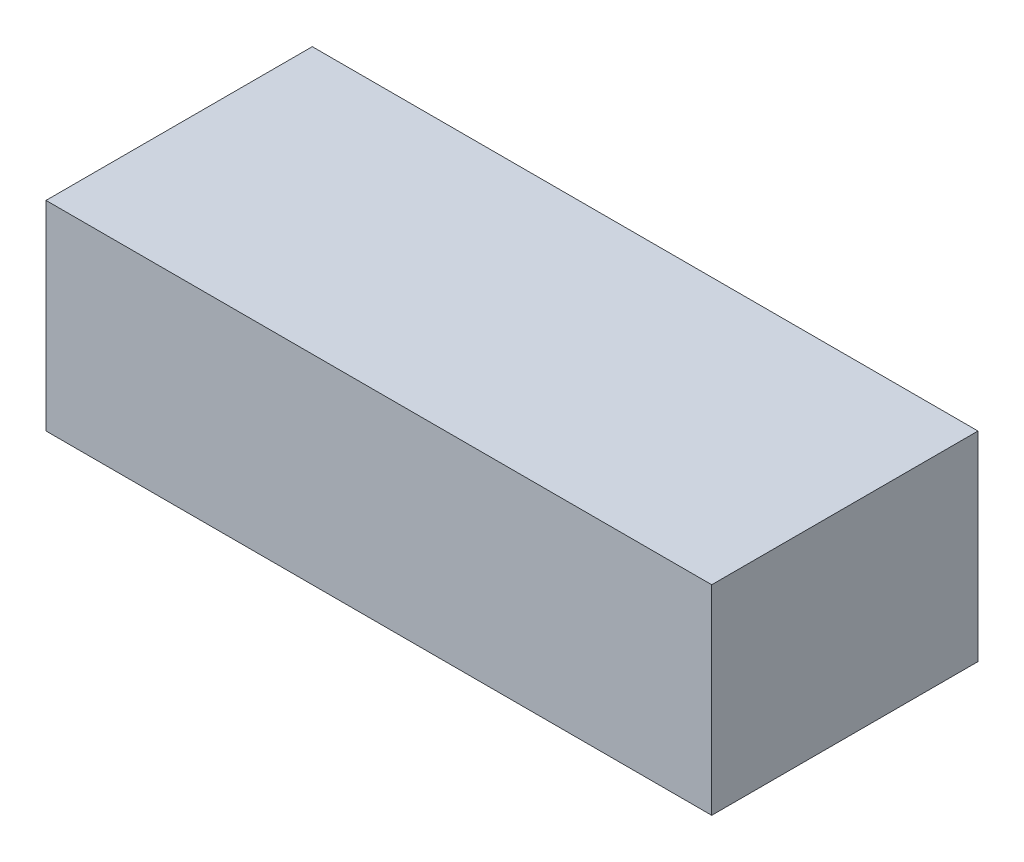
ISO-10303-21;
HEADER;
FILE_DESCRIPTION(('STEP AP214'),'2;1');
FILE_NAME('part.step','',(''),(''),'','','');
FILE_SCHEMA(('AUTOMOTIVE_DESIGN { 1 0 10303 214 1 1 1 1 }'));
ENDSEC;
DATA;
#1=APPLICATION_CONTEXT('core data for automotive mechanical design processes');
#2=APPLICATION_PROTOCOL_DEFINITION('international standard','automotive_design',2000,#1);
#3=PRODUCT_CONTEXT('',#1,'mechanical');
#4=PRODUCT('Part','Part','',(#3));
#5=PRODUCT_RELATED_PRODUCT_CATEGORY('part','',(#4));
#6=PRODUCT_DEFINITION_FORMATION('','',#4);
#7=PRODUCT_DEFINITION_CONTEXT('part definition',#1,'design');
#8=PRODUCT_DEFINITION('design','',#6,#7);
#9=PRODUCT_DEFINITION_SHAPE('','',#8);
#10=(LENGTH_UNIT() NAMED_UNIT(*) SI_UNIT(.MILLI.,.METRE.));
#11=(NAMED_UNIT(*) PLANE_ANGLE_UNIT() SI_UNIT($,.RADIAN.));
#12=(NAMED_UNIT(*) SI_UNIT($,.STERADIAN.) SOLID_ANGLE_UNIT());
#13=UNCERTAINTY_MEASURE_WITH_UNIT(LENGTH_MEASURE(1.E-05),#10,'distance_accuracy_value','');
#14=(GEOMETRIC_REPRESENTATION_CONTEXT(3) GLOBAL_UNCERTAINTY_ASSIGNED_CONTEXT((#13)) GLOBAL_UNIT_ASSIGNED_CONTEXT((#10,
#11,#12)) REPRESENTATION_CONTEXT('',''));
#15=CARTESIAN_POINT('',(0.,0.,0.));
#16=DIRECTION('',(0.,0.,1.));
#17=DIRECTION('',(1.,0.,0.));
#18=AXIS2_PLACEMENT_3D('',#15,#16,#17);
#19=CARTESIAN_POINT('',(-250.,-75.,100.));
#20=DIRECTION('',(1.,0.,0.));
#21=DIRECTION('',(0.,0.,-1.));
#22=AXIS2_PLACEMENT_3D('',#19,#20,#21);
#23=PLANE('',#22);
#24=DIRECTION('',(0.,-1.,0.));
#25=VECTOR('',#24,1.);
#26=CARTESIAN_POINT('',(-250.,-75.,-100.));
#27=LINE('',#26,#25);
#28=CARTESIAN_POINT('',(-250.,75.,-100.));
#29=VERTEX_POINT('',#28);
#30=CARTESIAN_POINT('',(-250.,-75.,-100.));
#31=VERTEX_POINT('',#30);
#32=EDGE_CURVE('E133',#29,#31,#27,.T.);
#33=ORIENTED_EDGE('',*,*,#32,.T.);
#34=DIRECTION('',(0.,0.,-1.));
#35=VECTOR('',#34,1.);
#36=CARTESIAN_POINT('',(-250.,-75.,100.));
#37=LINE('',#36,#35);
#38=CARTESIAN_POINT('',(-250.,-75.,100.));
#39=VERTEX_POINT('',#38);
#40=EDGE_CURVE('E11',#39,#31,#37,.T.);
#41=ORIENTED_EDGE('',*,*,#40,.F.);
#42=DIRECTION('',(0.,-1.,0.));
#43=VECTOR('',#42,1.);
#44=CARTESIAN_POINT('',(-250.,-75.,100.));
#45=LINE('',#44,#43);
#46=CARTESIAN_POINT('',(-250.,75.,100.));
#47=VERTEX_POINT('',#46);
#48=EDGE_CURVE('E134',#47,#39,#45,.T.);
#49=ORIENTED_EDGE('',*,*,#48,.F.);
#50=DIRECTION('',(0.,0.,-1.));
#51=VECTOR('',#50,1.);
#52=CARTESIAN_POINT('',(-250.,75.,100.));
#53=LINE('',#52,#51);
#54=EDGE_CURVE('E144',#47,#29,#53,.T.);
#55=ORIENTED_EDGE('',*,*,#54,.T.);
#56=EDGE_LOOP('',(#33,#41,#49,#55));
#57=FACE_BOUND('',#56,.T.);
#58=DIRECTION('',(0.,0.,-1.));
#59=VECTOR('',#58,1.);
#60=CARTESIAN_POINT('',(-250.,10.,5.));
#61=LINE('',#60,#59);
#62=CARTESIAN_POINT('',(-250.,10.,5.));
#63=VERTEX_POINT('',#62);
#64=CARTESIAN_POINT('',(-250.,10.,-5.));
#65=VERTEX_POINT('',#64);
#66=EDGE_CURVE('E46',#63,#65,#61,.T.);
#67=ORIENTED_EDGE('',*,*,#66,.F.);
#68=DIRECTION('',(0.,1.,0.));
#69=VECTOR('',#68,1.);
#70=CARTESIAN_POINT('',(-250.,10.,5.));
#71=LINE('',#70,#69);
#72=CARTESIAN_POINT('',(-250.,-10.,5.));
#73=VERTEX_POINT('',#72);
#74=EDGE_CURVE('E102',#73,#63,#71,.T.);
#75=ORIENTED_EDGE('',*,*,#74,.F.);
#76=DIRECTION('',(0.,0.,-1.));
#77=VECTOR('',#76,1.);
#78=CARTESIAN_POINT('',(-250.,-10.,5.));
#79=LINE('',#78,#77);
#80=CARTESIAN_POINT('',(-250.,-10.,-5.));
#81=VERTEX_POINT('',#80);
#82=EDGE_CURVE('E118',#73,#81,#79,.T.);
#83=ORIENTED_EDGE('',*,*,#82,.T.);
#84=DIRECTION('',(0.,1.,0.));
#85=VECTOR('',#84,1.);
#86=CARTESIAN_POINT('',(-250.,10.,-5.));
#87=LINE('',#86,#85);
#88=EDGE_CURVE('E51',#81,#65,#87,.T.);
#89=ORIENTED_EDGE('',*,*,#88,.T.);
#90=EDGE_LOOP('',(#67,#75,#83,#89));
#91=FACE_BOUND('',#90,.T.);
#92=ADVANCED_FACE('F32',(#57,#91),#23,.F.);
#93=CARTESIAN_POINT('',(-250.,-75.,100.));
#94=DIRECTION('',(0.,1.,0.));
#95=DIRECTION('',(0.,0.,1.));
#96=AXIS2_PLACEMENT_3D('',#93,#94,#95);
#97=PLANE('',#96);
#98=DIRECTION('',(1.,0.,0.));
#99=VECTOR('',#98,1.);
#100=CARTESIAN_POINT('',(-250.,-75.,-100.));
#101=LINE('',#100,#99);
#102=CARTESIAN_POINT('',(250.,-75.,-100.));
#103=VERTEX_POINT('',#102);
#104=EDGE_CURVE('E147',#31,#103,#101,.T.);
#105=ORIENTED_EDGE('',*,*,#104,.T.);
#106=DIRECTION('',(0.,0.,-1.));
#107=VECTOR('',#106,1.);
#108=CARTESIAN_POINT('',(250.,-75.,100.));
#109=LINE('',#108,#107);
#110=CARTESIAN_POINT('',(250.,-75.,100.));
#111=VERTEX_POINT('',#110);
#112=EDGE_CURVE('E39',#111,#103,#109,.T.);
#113=ORIENTED_EDGE('',*,*,#112,.F.);
#114=DIRECTION('',(1.,0.,0.));
#115=VECTOR('',#114,1.);
#116=CARTESIAN_POINT('',(-250.,-75.,100.));
#117=LINE('',#116,#115);
#118=EDGE_CURVE('E137',#39,#111,#117,.T.);
#119=ORIENTED_EDGE('',*,*,#118,.F.);
#120=ORIENTED_EDGE('',*,*,#40,.T.);
#121=EDGE_LOOP('',(#105,#113,#119,#120));
#122=FACE_BOUND('',#121,.T.);
#123=ADVANCED_FACE('F177',(#122),#97,.F.);
#124=CARTESIAN_POINT('',(250.,-75.,100.));
#125=DIRECTION('',(-1.,0.,0.));
#126=DIRECTION('',(0.,0.,1.));
#127=AXIS2_PLACEMENT_3D('',#124,#125,#126);
#128=PLANE('',#127);
#129=DIRECTION('',(0.,1.,0.));
#130=VECTOR('',#129,1.);
#131=CARTESIAN_POINT('',(250.,-75.,-100.));
#132=LINE('',#131,#130);
#133=CARTESIAN_POINT('',(250.,75.,-100.));
#134=VERTEX_POINT('',#133);
#135=EDGE_CURVE('E149',#103,#134,#132,.T.);
#136=ORIENTED_EDGE('',*,*,#135,.T.);
#137=DIRECTION('',(0.,0.,-1.));
#138=VECTOR('',#137,1.);
#139=CARTESIAN_POINT('',(250.,75.,100.));
#140=LINE('',#139,#138);
#141=CARTESIAN_POINT('',(250.,75.,100.));
#142=VERTEX_POINT('',#141);
#143=EDGE_CURVE('E154',#142,#134,#140,.T.);
#144=ORIENTED_EDGE('',*,*,#143,.F.);
#145=DIRECTION('',(0.,1.,0.));
#146=VECTOR('',#145,1.);
#147=CARTESIAN_POINT('',(250.,-75.,100.));
#148=LINE('',#147,#146);
#149=EDGE_CURVE('E140',#111,#142,#148,.T.);
#150=ORIENTED_EDGE('',*,*,#149,.F.);
#151=ORIENTED_EDGE('',*,*,#112,.T.);
#152=EDGE_LOOP('',(#136,#144,#150,#151));
#153=FACE_BOUND('',#152,.T.);
#154=ADVANCED_FACE('F161',(#153),#128,.F.);
#155=CARTESIAN_POINT('',(-250.,75.,100.));
#156=DIRECTION('',(0.,-1.,0.));
#157=DIRECTION('',(0.,0.,-1.));
#158=AXIS2_PLACEMENT_3D('',#155,#156,#157);
#159=PLANE('',#158);
#160=DIRECTION('',(-1.,0.,0.));
#161=VECTOR('',#160,1.);
#162=CARTESIAN_POINT('',(-250.,75.,-100.));
#163=LINE('',#162,#161);
#164=EDGE_CURVE('E138',#134,#29,#163,.T.);
#165=ORIENTED_EDGE('',*,*,#164,.T.);
#166=ORIENTED_EDGE('',*,*,#54,.F.);
#167=DIRECTION('',(-1.,0.,0.));
#168=VECTOR('',#167,1.);
#169=CARTESIAN_POINT('',(-250.,75.,100.));
#170=LINE('',#169,#168);
#171=EDGE_CURVE('E142',#142,#47,#170,.T.);
#172=ORIENTED_EDGE('',*,*,#171,.F.);
#173=ORIENTED_EDGE('',*,*,#143,.T.);
#174=EDGE_LOOP('',(#165,#166,#172,#173));
#175=FACE_BOUND('',#174,.T.);
#176=ADVANCED_FACE('F170',(#175),#159,.F.);
#177=CARTESIAN_POINT('',(-250.,75.,100.));
#178=DIRECTION('',(0.,0.,-1.));
#179=DIRECTION('',(-1.,0.,0.));
#180=AXIS2_PLACEMENT_3D('',#177,#178,#179);
#181=PLANE('',#180);
#182=ORIENTED_EDGE('',*,*,#48,.T.);
#183=ORIENTED_EDGE('',*,*,#118,.T.);
#184=ORIENTED_EDGE('',*,*,#149,.T.);
#185=ORIENTED_EDGE('',*,*,#171,.T.);
#186=EDGE_LOOP('',(#182,#183,#184,#185));
#187=FACE_BOUND('',#186,.T.);
#188=ADVANCED_FACE('F176',(#187),#181,.F.);
#189=CARTESIAN_POINT('',(-250.,75.,-100.));
#190=DIRECTION('',(0.,0.,-1.));
#191=DIRECTION('',(-1.,0.,0.));
#192=AXIS2_PLACEMENT_3D('',#189,#190,#191);
#193=PLANE('',#192);
#194=ORIENTED_EDGE('',*,*,#32,.F.);
#195=ORIENTED_EDGE('',*,*,#164,.F.);
#196=ORIENTED_EDGE('',*,*,#135,.F.);
#197=ORIENTED_EDGE('',*,*,#104,.F.);
#198=EDGE_LOOP('',(#194,#195,#196,#197));
#199=FACE_BOUND('',#198,.T.);
#200=ADVANCED_FACE('F167',(#199),#193,.T.);
#201=CARTESIAN_POINT('',(-270.,0.,5.));
#202=DIRECTION('',(0.,0.,1.));
#203=DIRECTION('',(1.,0.,0.));
#204=AXIS2_PLACEMENT_3D('',#201,#202,#203);
#205=PLANE('',#204);
#206=ORIENTED_EDGE('',*,*,#74,.T.);
#207=DIRECTION('',(-1.,0.,0.));
#208=VECTOR('',#207,1.);
#209=CARTESIAN_POINT('',(-250.,10.,5.));
#210=LINE('',#209,#208);
#211=CARTESIAN_POINT('',(-270.,10.,5.));
#212=VERTEX_POINT('',#211);
#213=EDGE_CURVE('E94',#63,#212,#210,.T.);
#214=ORIENTED_EDGE('',*,*,#213,.T.);
#215=CARTESIAN_POINT('',(-270.,0.,5.));
#216=DIRECTION('',(0.,0.,1.));
#217=DIRECTION('',(1.,0.,0.));
#218=AXIS2_PLACEMENT_3D('',#215,#216,#217);
#219=CIRCLE('',#218,10.);
#220=CARTESIAN_POINT('',(-270.,-10.,5.));
#221=VERTEX_POINT('',#220);
#222=EDGE_CURVE('E100',#212,#221,#219,.T.);
#223=ORIENTED_EDGE('',*,*,#222,.T.);
#224=DIRECTION('',(1.,0.,0.));
#225=VECTOR('',#224,1.);
#226=CARTESIAN_POINT('',(-250.,-10.,5.));
#227=LINE('',#226,#225);
#228=EDGE_CURVE('E116',#221,#73,#227,.T.);
#229=ORIENTED_EDGE('',*,*,#228,.T.);
#230=EDGE_LOOP('',(#206,#214,#223,#229));
#231=FACE_BOUND('',#230,.T.);
#232=CARTESIAN_POINT('',(-270.,0.,5.));
#233=DIRECTION('',(0.,0.,1.));
#234=DIRECTION('',(1.,0.,0.));
#235=AXIS2_PLACEMENT_3D('',#232,#233,#234);
#236=CIRCLE('',#235,4.99999999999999);
#237=CARTESIAN_POINT('',(-265.,0.,5.));
#238=VERTEX_POINT('',#237);
#239=EDGE_CURVE('E123',#238,#238,#236,.T.);
#240=ORIENTED_EDGE('',*,*,#239,.F.);
#241=EDGE_LOOP('',(#240));
#242=FACE_BOUND('',#241,.T.);
#243=ADVANCED_FACE('F96',(#231,#242),#205,.T.);
#244=CARTESIAN_POINT('',(-270.,0.,-5.));
#245=DIRECTION('',(0.,0.,1.));
#246=DIRECTION('',(1.,0.,0.));
#247=AXIS2_PLACEMENT_3D('',#244,#245,#246);
#248=PLANE('',#247);
#249=ORIENTED_EDGE('',*,*,#88,.F.);
#250=DIRECTION('',(1.,0.,0.));
#251=VECTOR('',#250,1.);
#252=CARTESIAN_POINT('',(-250.,-10.,-5.));
#253=LINE('',#252,#251);
#254=CARTESIAN_POINT('',(-270.,-10.,-5.));
#255=VERTEX_POINT('',#254);
#256=EDGE_CURVE('E127',#255,#81,#253,.T.);
#257=ORIENTED_EDGE('',*,*,#256,.F.);
#258=CARTESIAN_POINT('',(-270.,0.,-5.));
#259=DIRECTION('',(0.,0.,1.));
#260=DIRECTION('',(1.,0.,0.));
#261=AXIS2_PLACEMENT_3D('',#258,#259,#260);
#262=CIRCLE('',#261,10.);
#263=CARTESIAN_POINT('',(-270.,10.,-5.));
#264=VERTEX_POINT('',#263);
#265=EDGE_CURVE('E125',#264,#255,#262,.T.);
#266=ORIENTED_EDGE('',*,*,#265,.F.);
#267=DIRECTION('',(-1.,0.,0.));
#268=VECTOR('',#267,1.);
#269=CARTESIAN_POINT('',(-250.,10.,-5.));
#270=LINE('',#269,#268);
#271=EDGE_CURVE('E108',#65,#264,#270,.T.);
#272=ORIENTED_EDGE('',*,*,#271,.F.);
#273=EDGE_LOOP('',(#249,#257,#266,#272));
#274=FACE_BOUND('',#273,.T.);
#275=CARTESIAN_POINT('',(-270.,0.,-5.));
#276=DIRECTION('',(0.,0.,1.));
#277=DIRECTION('',(1.,0.,0.));
#278=AXIS2_PLACEMENT_3D('',#275,#276,#277);
#279=CIRCLE('',#278,4.99999999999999);
#280=CARTESIAN_POINT('',(-265.,0.,-5.));
#281=VERTEX_POINT('',#280);
#282=EDGE_CURVE('E215',#281,#281,#279,.T.);
#283=ORIENTED_EDGE('',*,*,#282,.T.);
#284=EDGE_LOOP('',(#283));
#285=FACE_BOUND('',#284,.T.);
#286=ADVANCED_FACE('F193',(#274,#285),#248,.F.);
#287=CARTESIAN_POINT('',(-250.,10.,5.));
#288=DIRECTION('',(0.,-1.,0.));
#289=DIRECTION('',(1.,0.,0.));
#290=AXIS2_PLACEMENT_3D('',#287,#288,#289);
#291=PLANE('',#290);
#292=ORIENTED_EDGE('',*,*,#271,.T.);
#293=DIRECTION('',(0.,0.,-1.));
#294=VECTOR('',#293,1.);
#295=CARTESIAN_POINT('',(-270.,10.,5.));
#296=LINE('',#295,#294);
#297=EDGE_CURVE('E106',#212,#264,#296,.T.);
#298=ORIENTED_EDGE('',*,*,#297,.F.);
#299=ORIENTED_EDGE('',*,*,#213,.F.);
#300=ORIENTED_EDGE('',*,*,#66,.T.);
#301=EDGE_LOOP('',(#292,#298,#299,#300));
#302=FACE_BOUND('',#301,.T.);
#303=ADVANCED_FACE('F107',(#302),#291,.F.);
#304=CARTESIAN_POINT('',(-270.,0.,5.));
#305=DIRECTION('',(0.,0.,-1.));
#306=DIRECTION('',(-1.,0.,0.));
#307=AXIS2_PLACEMENT_3D('',#304,#305,#306);
#308=CYLINDRICAL_SURFACE('',#307,10.);
#309=ORIENTED_EDGE('',*,*,#265,.T.);
#310=DIRECTION('',(0.,0.,-1.));
#311=VECTOR('',#310,1.);
#312=CARTESIAN_POINT('',(-270.,-10.,5.));
#313=LINE('',#312,#311);
#314=EDGE_CURVE('E111',#221,#255,#313,.T.);
#315=ORIENTED_EDGE('',*,*,#314,.F.);
#316=ORIENTED_EDGE('',*,*,#222,.F.);
#317=ORIENTED_EDGE('',*,*,#297,.T.);
#318=EDGE_LOOP('',(#309,#315,#316,#317));
#319=FACE_BOUND('',#318,.T.);
#320=ADVANCED_FACE('F113',(#319),#308,.T.);
#321=CARTESIAN_POINT('',(-250.,-10.,5.));
#322=DIRECTION('',(0.,1.,0.));
#323=DIRECTION('',(-1.,0.,0.));
#324=AXIS2_PLACEMENT_3D('',#321,#322,#323);
#325=PLANE('',#324);
#326=ORIENTED_EDGE('',*,*,#256,.T.);
#327=ORIENTED_EDGE('',*,*,#82,.F.);
#328=ORIENTED_EDGE('',*,*,#228,.F.);
#329=ORIENTED_EDGE('',*,*,#314,.T.);
#330=EDGE_LOOP('',(#326,#327,#328,#329));
#331=FACE_BOUND('',#330,.T.);
#332=ADVANCED_FACE('F196',(#331),#325,.F.);
#333=CARTESIAN_POINT('',(-270.,0.,5.));
#334=DIRECTION('',(0.,0.,-1.));
#335=DIRECTION('',(-1.,0.,0.));
#336=AXIS2_PLACEMENT_3D('',#333,#334,#335);
#337=CYLINDRICAL_SURFACE('',#336,4.99999999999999);
#338=ORIENTED_EDGE('',*,*,#239,.T.);
#339=EDGE_LOOP('',(#338));
#340=FACE_BOUND('',#339,.T.);
#341=ORIENTED_EDGE('',*,*,#282,.F.);
#342=EDGE_LOOP('',(#341));
#343=FACE_BOUND('',#342,.T.);
#344=ADVANCED_FACE('F199',(#340,#343),#337,.F.);
#345=CLOSED_SHELL('',(#92,#123,#154,#176,#188,#200,#243,#286,#303,#320,#332,#344));
#346=MANIFOLD_SOLID_BREP('B2',#345);
#347=ADVANCED_BREP_SHAPE_REPRESENTATION('',(#18,#346),#14);
#348=SHAPE_DEFINITION_REPRESENTATION(#9,#347);
ENDSEC;
END-ISO-10303-21;
